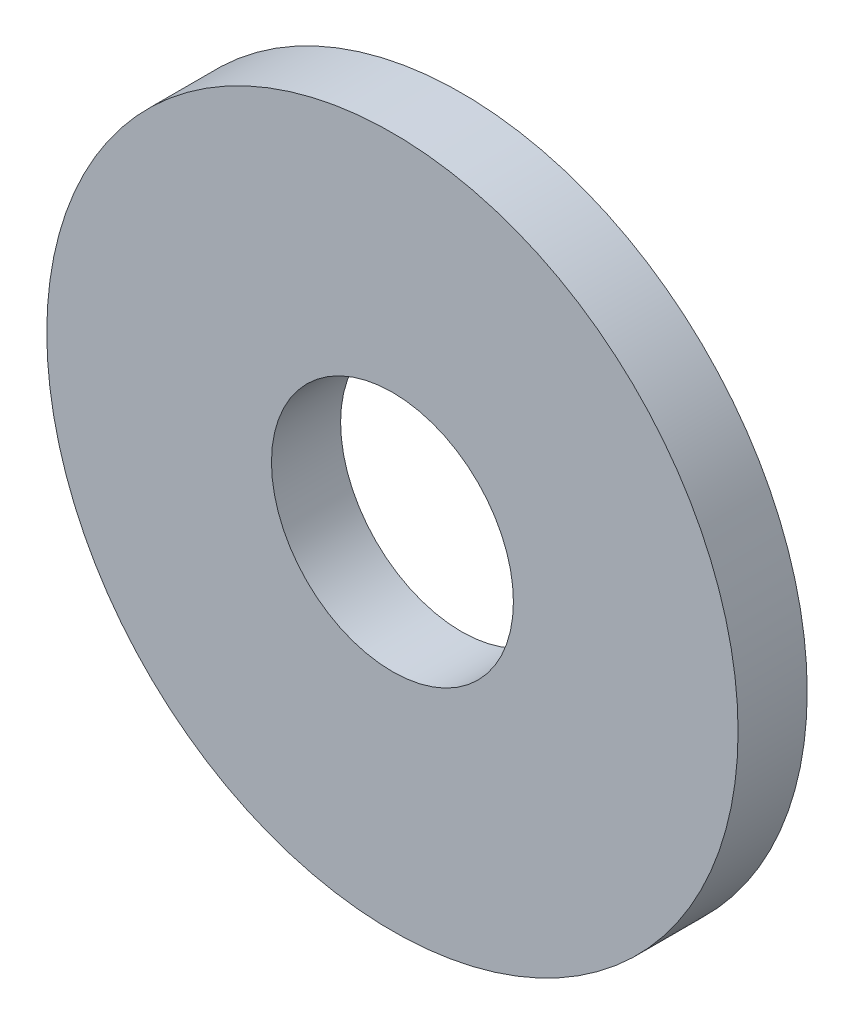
ISO-10303-21;
HEADER;
FILE_DESCRIPTION(('STEP AP214'),'2;1');
FILE_NAME('part.step','',(''),(''),'','','');
FILE_SCHEMA(('AUTOMOTIVE_DESIGN { 1 0 10303 214 1 1 1 1 }'));
ENDSEC;
DATA;
#1=APPLICATION_CONTEXT('core data for automotive mechanical design processes');
#2=APPLICATION_PROTOCOL_DEFINITION('international standard','automotive_design',2000,#1);
#3=PRODUCT_CONTEXT('',#1,'mechanical');
#4=PRODUCT('Part','Part','',(#3));
#5=PRODUCT_RELATED_PRODUCT_CATEGORY('part','',(#4));
#6=PRODUCT_DEFINITION_FORMATION('','',#4);
#7=PRODUCT_DEFINITION_CONTEXT('part definition',#1,'design');
#8=PRODUCT_DEFINITION('design','',#6,#7);
#9=PRODUCT_DEFINITION_SHAPE('','',#8);
#10=(LENGTH_UNIT() NAMED_UNIT(*) SI_UNIT(.MILLI.,.METRE.));
#11=(NAMED_UNIT(*) PLANE_ANGLE_UNIT() SI_UNIT($,.RADIAN.));
#12=(NAMED_UNIT(*) SI_UNIT($,.STERADIAN.) SOLID_ANGLE_UNIT());
#13=UNCERTAINTY_MEASURE_WITH_UNIT(LENGTH_MEASURE(1.E-05),#10,'distance_accuracy_value','');
#14=(GEOMETRIC_REPRESENTATION_CONTEXT(3) GLOBAL_UNCERTAINTY_ASSIGNED_CONTEXT((#13)) GLOBAL_UNIT_ASSIGNED_CONTEXT((#10,
#11,#12)) REPRESENTATION_CONTEXT('',''));
#15=CARTESIAN_POINT('',(0.,0.,0.));
#16=DIRECTION('',(0.,0.,1.));
#17=DIRECTION('',(1.,0.,0.));
#18=AXIS2_PLACEMENT_3D('',#15,#16,#17);
#19=CARTESIAN_POINT('',(0.,0.,3.));
#20=DIRECTION('',(0.,0.,1.));
#21=DIRECTION('',(1.,0.,0.));
#22=AXIS2_PLACEMENT_3D('',#19,#20,#21);
#23=PLANE('',#22);
#24=CARTESIAN_POINT('',(0.,0.,3.));
#25=DIRECTION('',(0.,0.,1.));
#26=DIRECTION('',(1.,0.,0.));
#27=AXIS2_PLACEMENT_3D('',#24,#25,#26);
#28=CIRCLE('',#27,15.);
#29=CARTESIAN_POINT('',(15.,0.,3.));
#30=VERTEX_POINT('',#29);
#31=EDGE_CURVE('E10',#30,#30,#28,.T.);
#32=ORIENTED_EDGE('',*,*,#31,.T.);
#33=EDGE_LOOP('',(#32));
#34=FACE_BOUND('',#33,.T.);
#35=CARTESIAN_POINT('',(0.,0.,3.));
#36=DIRECTION('',(0.,0.,1.));
#37=DIRECTION('',(1.,0.,0.));
#38=AXIS2_PLACEMENT_3D('',#35,#36,#37);
#39=CIRCLE('',#38,5.25);
#40=CARTESIAN_POINT('',(5.25,0.,3.));
#41=VERTEX_POINT('',#40);
#42=EDGE_CURVE('E39',#41,#41,#39,.T.);
#43=ORIENTED_EDGE('',*,*,#42,.F.);
#44=EDGE_LOOP('',(#43));
#45=FACE_BOUND('',#44,.T.);
#46=ADVANCED_FACE('F28',(#34,#45),#23,.T.);
#47=CARTESIAN_POINT('',(0.,0.,0.));
#48=DIRECTION('',(0.,0.,1.));
#49=DIRECTION('',(1.,0.,0.));
#50=AXIS2_PLACEMENT_3D('',#47,#48,#49);
#51=PLANE('',#50);
#52=CARTESIAN_POINT('',(0.,0.,0.));
#53=DIRECTION('',(0.,0.,1.));
#54=DIRECTION('',(1.,0.,0.));
#55=AXIS2_PLACEMENT_3D('',#52,#53,#54);
#56=CIRCLE('',#55,15.);
#57=CARTESIAN_POINT('',(15.,0.,0.));
#58=VERTEX_POINT('',#57);
#59=EDGE_CURVE('E32',#58,#58,#56,.T.);
#60=ORIENTED_EDGE('',*,*,#59,.F.);
#61=EDGE_LOOP('',(#60));
#62=FACE_BOUND('',#61,.T.);
#63=CARTESIAN_POINT('',(0.,0.,0.));
#64=DIRECTION('',(0.,0.,1.));
#65=DIRECTION('',(1.,0.,0.));
#66=AXIS2_PLACEMENT_3D('',#63,#64,#65);
#67=CIRCLE('',#66,5.25);
#68=CARTESIAN_POINT('',(5.25,0.,0.));
#69=VERTEX_POINT('',#68);
#70=EDGE_CURVE('E41',#69,#69,#67,.T.);
#71=ORIENTED_EDGE('',*,*,#70,.T.);
#72=EDGE_LOOP('',(#71));
#73=FACE_BOUND('',#72,.T.);
#74=ADVANCED_FACE('F51',(#62,#73),#51,.F.);
#75=CARTESIAN_POINT('',(0.,0.,3.));
#76=DIRECTION('',(0.,0.,-1.));
#77=DIRECTION('',(-1.,0.,0.));
#78=AXIS2_PLACEMENT_3D('',#75,#76,#77);
#79=CYLINDRICAL_SURFACE('',#78,15.);
#80=ORIENTED_EDGE('',*,*,#31,.F.);
#81=EDGE_LOOP('',(#80));
#82=FACE_BOUND('',#81,.T.);
#83=ORIENTED_EDGE('',*,*,#59,.T.);
#84=EDGE_LOOP('',(#83));
#85=FACE_BOUND('',#84,.T.);
#86=ADVANCED_FACE('F30',(#82,#85),#79,.T.);
#87=CARTESIAN_POINT('',(0.,0.,3.));
#88=DIRECTION('',(0.,0.,-1.));
#89=DIRECTION('',(-1.,0.,0.));
#90=AXIS2_PLACEMENT_3D('',#87,#88,#89);
#91=CYLINDRICAL_SURFACE('',#90,5.25);
#92=ORIENTED_EDGE('',*,*,#42,.T.);
#93=EDGE_LOOP('',(#92));
#94=FACE_BOUND('',#93,.T.);
#95=ORIENTED_EDGE('',*,*,#70,.F.);
#96=EDGE_LOOP('',(#95));
#97=FACE_BOUND('',#96,.T.);
#98=ADVANCED_FACE('F47',(#94,#97),#91,.F.);
#99=CLOSED_SHELL('',(#46,#74,#86,#98));
#100=MANIFOLD_SOLID_BREP('B2',#99);
#101=ADVANCED_BREP_SHAPE_REPRESENTATION('',(#18,#100),#14);
#102=SHAPE_DEFINITION_REPRESENTATION(#9,#101);
ENDSEC;
END-ISO-10303-21;
